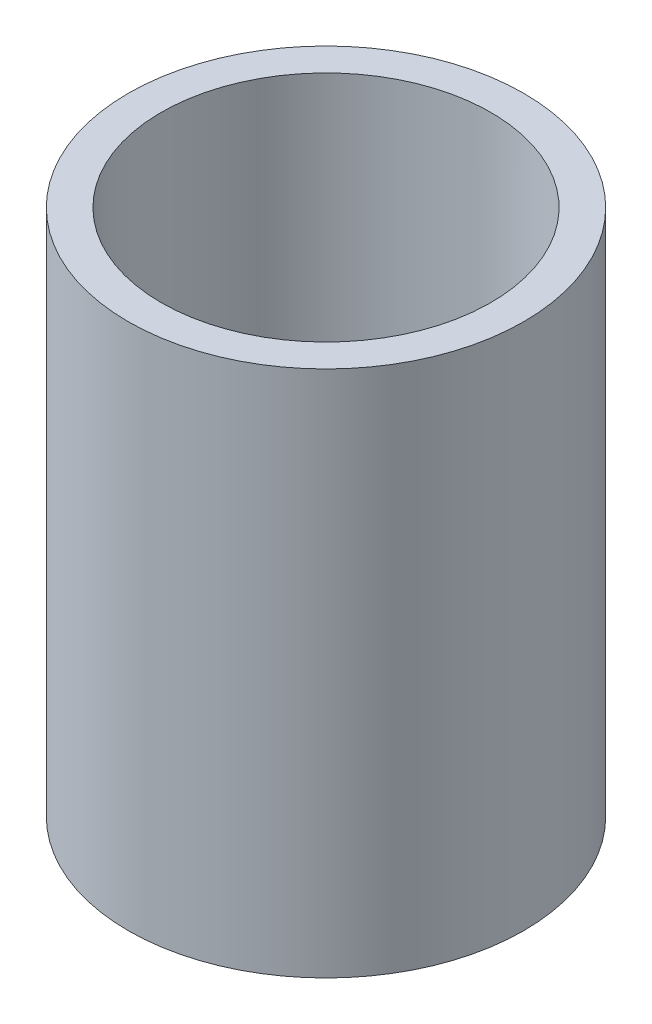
ISO-10303-21;
HEADER;
FILE_DESCRIPTION(('STEP AP214'),'2;1');
FILE_NAME('part.step','',(''),(''),'','','');
FILE_SCHEMA(('AUTOMOTIVE_DESIGN { 1 0 10303 214 1 1 1 1 }'));
ENDSEC;
DATA;
#1=APPLICATION_CONTEXT('core data for automotive mechanical design processes');
#2=APPLICATION_PROTOCOL_DEFINITION('international standard','automotive_design',2000,#1);
#3=PRODUCT_CONTEXT('',#1,'mechanical');
#4=PRODUCT('Part','Part','',(#3));
#5=PRODUCT_RELATED_PRODUCT_CATEGORY('part','',(#4));
#6=PRODUCT_DEFINITION_FORMATION('','',#4);
#7=PRODUCT_DEFINITION_CONTEXT('part definition',#1,'design');
#8=PRODUCT_DEFINITION('design','',#6,#7);
#9=PRODUCT_DEFINITION_SHAPE('','',#8);
#10=(LENGTH_UNIT() NAMED_UNIT(*) SI_UNIT(.MILLI.,.METRE.));
#11=(NAMED_UNIT(*) PLANE_ANGLE_UNIT() SI_UNIT($,.RADIAN.));
#12=(NAMED_UNIT(*) SI_UNIT($,.STERADIAN.) SOLID_ANGLE_UNIT());
#13=UNCERTAINTY_MEASURE_WITH_UNIT(LENGTH_MEASURE(1.E-05),#10,'distance_accuracy_value','');
#14=(GEOMETRIC_REPRESENTATION_CONTEXT(3) GLOBAL_UNCERTAINTY_ASSIGNED_CONTEXT((#13)) GLOBAL_UNIT_ASSIGNED_CONTEXT((#10,
#11,#12)) REPRESENTATION_CONTEXT('',''));
#15=CARTESIAN_POINT('',(0.,0.,0.));
#16=DIRECTION('',(0.,0.,1.));
#17=DIRECTION('',(1.,0.,0.));
#18=AXIS2_PLACEMENT_3D('',#15,#16,#17);
#19=CARTESIAN_POINT('',(99.,-140.75277675,-84.));
#20=DIRECTION('',(0.,1.,0.));
#21=DIRECTION('',(0.,0.,1.));
#22=AXIS2_PLACEMENT_3D('',#19,#20,#21);
#23=CONICAL_SURFACE('',#22,6.00000000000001,1.04719755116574);
#24=CARTESIAN_POINT('',(99.,-137.,-84.));
#25=DIRECTION('',(0.,1.,0.));
#26=DIRECTION('',(1.,0.,0.));
#27=AXIS2_PLACEMENT_3D('',#24,#25,#26);
#28=CIRCLE('',#27,12.5);
#29=CARTESIAN_POINT('',(111.5,-137.,-84.));
#30=VERTEX_POINT('',#29);
#31=EDGE_CURVE('E38',#30,#30,#28,.F.);
#32=ORIENTED_EDGE('',*,*,#31,.F.);
#33=EDGE_LOOP('',(#32));
#34=FACE_BOUND('',#33,.T.);
#35=CARTESIAN_POINT('',(99.,-140.75277675,-84.));
#36=DIRECTION('',(0.,-1.,0.));
#37=DIRECTION('',(-1.,0.,0.));
#38=AXIS2_PLACEMENT_3D('',#35,#36,#37);
#39=CIRCLE('',#38,6.00000000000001);
#40=CARTESIAN_POINT('',(93.,-140.75277675,-84.));
#41=VERTEX_POINT('',#40);
#42=EDGE_CURVE('E44',#41,#41,#39,.F.);
#43=ORIENTED_EDGE('',*,*,#42,.F.);
#44=EDGE_LOOP('',(#43));
#45=FACE_BOUND('',#44,.T.);
#46=ADVANCED_FACE('F22',(#34,#45),#23,.F.);
#47=CARTESIAN_POINT('',(99.,-137.,-84.));
#48=DIRECTION('',(0.,1.,0.));
#49=DIRECTION('',(0.,0.,1.));
#50=AXIS2_PLACEMENT_3D('',#47,#48,#49);
#51=CYLINDRICAL_SURFACE('',#50,12.5);
#52=ORIENTED_EDGE('',*,*,#31,.T.);
#53=EDGE_LOOP('',(#52));
#54=FACE_BOUND('',#53,.T.);
#55=CARTESIAN_POINT('',(99.,-111.,-84.));
#56=DIRECTION('',(0.,1.,0.));
#57=DIRECTION('',(0.,0.,1.));
#58=AXIS2_PLACEMENT_3D('',#55,#56,#57);
#59=CIRCLE('',#58,12.5);
#60=CARTESIAN_POINT('',(99.,-111.,-71.5));
#61=VERTEX_POINT('',#60);
#62=EDGE_CURVE('E26',#61,#61,#59,.F.);
#63=ORIENTED_EDGE('',*,*,#62,.F.);
#64=EDGE_LOOP('',(#63));
#65=FACE_BOUND('',#64,.T.);
#66=ADVANCED_FACE('F53',(#54,#65),#51,.F.);
#67=CARTESIAN_POINT('',(99.,-140.75277675,-84.));
#68=DIRECTION('',(0.,-1.,0.));
#69=DIRECTION('',(0.,0.,-1.));
#70=AXIS2_PLACEMENT_3D('',#67,#68,#69);
#71=CYLINDRICAL_SURFACE('',#70,6.00000000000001);
#72=ORIENTED_EDGE('',*,*,#42,.T.);
#73=EDGE_LOOP('',(#72));
#74=FACE_BOUND('',#73,.T.);
#75=CARTESIAN_POINT('',(99.,-151.,-84.));
#76=DIRECTION('',(0.,-1.,0.));
#77=DIRECTION('',(0.,0.,-1.));
#78=AXIS2_PLACEMENT_3D('',#75,#76,#77);
#79=CIRCLE('',#78,6.00000000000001);
#80=CARTESIAN_POINT('',(99.,-151.,-90.));
#81=VERTEX_POINT('',#80);
#82=EDGE_CURVE('E35',#81,#81,#79,.F.);
#83=ORIENTED_EDGE('',*,*,#82,.F.);
#84=EDGE_LOOP('',(#83));
#85=FACE_BOUND('',#84,.T.);
#86=ADVANCED_FACE('F63',(#74,#85),#71,.F.);
#87=CARTESIAN_POINT('',(83.82,-111.,-68.82));
#88=DIRECTION('',(0.,1.,0.));
#89=DIRECTION('',(1.,0.,0.));
#90=AXIS2_PLACEMENT_3D('',#87,#88,#89);
#91=PLANE('',#90);
#92=ORIENTED_EDGE('',*,*,#62,.T.);
#93=EDGE_LOOP('',(#92));
#94=FACE_BOUND('',#93,.T.);
#95=CARTESIAN_POINT('',(99.,-111.,-84.));
#96=DIRECTION('',(0.,1.,0.));
#97=DIRECTION('',(0.,0.,1.));
#98=AXIS2_PLACEMENT_3D('',#95,#96,#97);
#99=CIRCLE('',#98,15.);
#100=CARTESIAN_POINT('',(99.,-111.,-69.));
#101=VERTEX_POINT('',#100);
#102=EDGE_CURVE('E30',#101,#101,#99,.T.);
#103=ORIENTED_EDGE('',*,*,#102,.T.);
#104=EDGE_LOOP('',(#103));
#105=FACE_BOUND('',#104,.T.);
#106=ADVANCED_FACE('F72',(#94,#105),#91,.T.);
#107=CARTESIAN_POINT('',(114.18,-151.,-68.82));
#108=DIRECTION('',(0.,-1.,0.));
#109=DIRECTION('',(-1.,0.,0.));
#110=AXIS2_PLACEMENT_3D('',#107,#108,#109);
#111=PLANE('',#110);
#112=ORIENTED_EDGE('',*,*,#82,.T.);
#113=EDGE_LOOP('',(#112));
#114=FACE_BOUND('',#113,.T.);
#115=CARTESIAN_POINT('',(99.,-151.,-84.));
#116=DIRECTION('',(0.,1.,0.));
#117=DIRECTION('',(0.,0.,1.));
#118=AXIS2_PLACEMENT_3D('',#115,#116,#117);
#119=CIRCLE('',#118,15.);
#120=CARTESIAN_POINT('',(99.,-151.,-69.));
#121=VERTEX_POINT('',#120);
#122=EDGE_CURVE('E12',#121,#121,#119,.F.);
#123=ORIENTED_EDGE('',*,*,#122,.T.);
#124=EDGE_LOOP('',(#123));
#125=FACE_BOUND('',#124,.T.);
#126=ADVANCED_FACE('F24',(#114,#125),#111,.T.);
#127=CARTESIAN_POINT('',(99.,-151.,-84.));
#128=DIRECTION('',(0.,1.,0.));
#129=DIRECTION('',(0.,0.,1.));
#130=AXIS2_PLACEMENT_3D('',#127,#128,#129);
#131=CYLINDRICAL_SURFACE('',#130,15.);
#132=ORIENTED_EDGE('',*,*,#102,.F.);
#133=EDGE_LOOP('',(#132));
#134=FACE_BOUND('',#133,.T.);
#135=ORIENTED_EDGE('',*,*,#122,.F.);
#136=EDGE_LOOP('',(#135));
#137=FACE_BOUND('',#136,.T.);
#138=ADVANCED_FACE('F65',(#134,#137),#131,.T.);
#139=CLOSED_SHELL('',(#46,#66,#86,#106,#126,#138));
#140=MANIFOLD_SOLID_BREP('B1',#139);
#141=ADVANCED_BREP_SHAPE_REPRESENTATION('',(#18,#140),#14);
#142=SHAPE_DEFINITION_REPRESENTATION(#9,#141);
ENDSEC;
END-ISO-10303-21;
